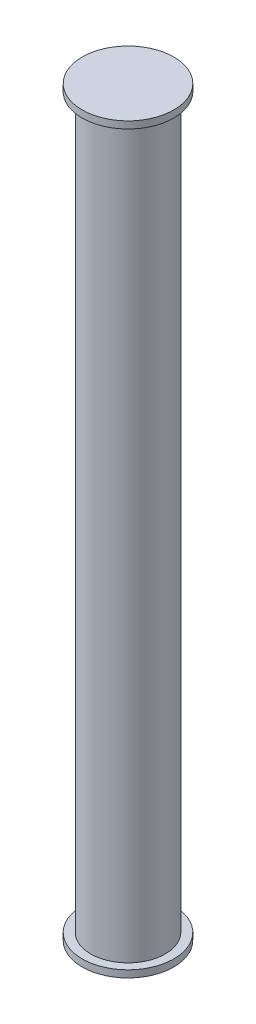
ISO-10303-21;
HEADER;
FILE_DESCRIPTION(('STEP AP214'),'2;1');
FILE_NAME('part.step','',(''),(''),'','','');
FILE_SCHEMA(('AUTOMOTIVE_DESIGN { 1 0 10303 214 1 1 1 1 }'));
ENDSEC;
DATA;
#1=APPLICATION_CONTEXT('core data for automotive mechanical design processes');
#2=APPLICATION_PROTOCOL_DEFINITION('international standard','automotive_design',2000,#1);
#3=PRODUCT_CONTEXT('',#1,'mechanical');
#4=PRODUCT('Part','Part','',(#3));
#5=PRODUCT_RELATED_PRODUCT_CATEGORY('part','',(#4));
#6=PRODUCT_DEFINITION_FORMATION('','',#4);
#7=PRODUCT_DEFINITION_CONTEXT('part definition',#1,'design');
#8=PRODUCT_DEFINITION('design','',#6,#7);
#9=PRODUCT_DEFINITION_SHAPE('','',#8);
#10=(LENGTH_UNIT() NAMED_UNIT(*) SI_UNIT(.MILLI.,.METRE.));
#11=(NAMED_UNIT(*) PLANE_ANGLE_UNIT() SI_UNIT($,.RADIAN.));
#12=(NAMED_UNIT(*) SI_UNIT($,.STERADIAN.) SOLID_ANGLE_UNIT());
#13=UNCERTAINTY_MEASURE_WITH_UNIT(LENGTH_MEASURE(1.E-05),#10,'distance_accuracy_value','');
#14=(GEOMETRIC_REPRESENTATION_CONTEXT(3) GLOBAL_UNCERTAINTY_ASSIGNED_CONTEXT((#13)) GLOBAL_UNIT_ASSIGNED_CONTEXT((#10,
#11,#12)) REPRESENTATION_CONTEXT('',''));
#15=CARTESIAN_POINT('',(0.,0.,0.));
#16=DIRECTION('',(0.,0.,1.));
#17=DIRECTION('',(1.,0.,0.));
#18=AXIS2_PLACEMENT_3D('',#15,#16,#17);
#19=CARTESIAN_POINT('',(0.,31.263,0.));
#20=DIRECTION('',(0.,1.,0.));
#21=DIRECTION('',(0.,0.,1.));
#22=AXIS2_PLACEMENT_3D('',#19,#20,#21);
#23=PLANE('',#22);
#24=CARTESIAN_POINT('',(0.,31.263,0.));
#25=DIRECTION('',(0.,1.,0.));
#26=DIRECTION('',(0.,0.,1.));
#27=AXIS2_PLACEMENT_3D('',#24,#25,#26);
#28=CIRCLE('',#27,1.95);
#29=CARTESIAN_POINT('',(0.,31.263,1.95));
#30=VERTEX_POINT('',#29);
#31=EDGE_CURVE('E18',#30,#30,#28,.F.);
#32=ORIENTED_EDGE('',*,*,#31,.F.);
#33=EDGE_LOOP('',(#32));
#34=FACE_BOUND('',#33,.T.);
#35=ADVANCED_FACE('F15',(#34),#23,.T.);
#36=CARTESIAN_POINT('',(0.,-0.3,0.));
#37=DIRECTION('',(0.,1.,0.));
#38=DIRECTION('',(0.,0.,1.));
#39=AXIS2_PLACEMENT_3D('',#36,#37,#38);
#40=PLANE('',#39);
#41=CARTESIAN_POINT('',(0.,-0.3,0.));
#42=DIRECTION('',(0.,-1.,0.));
#43=DIRECTION('',(0.,0.,-1.));
#44=AXIS2_PLACEMENT_3D('',#41,#42,#43);
#45=CIRCLE('',#44,1.95);
#46=CARTESIAN_POINT('',(0.,-0.3,-1.95));
#47=VERTEX_POINT('',#46);
#48=EDGE_CURVE('E34',#47,#47,#45,.F.);
#49=ORIENTED_EDGE('',*,*,#48,.F.);
#50=EDGE_LOOP('',(#49));
#51=FACE_BOUND('',#50,.T.);
#52=ADVANCED_FACE('F44',(#51),#40,.F.);
#53=CARTESIAN_POINT('',(0.,30.963,0.));
#54=DIRECTION('',(0.,1.,0.));
#55=DIRECTION('',(0.,0.,1.));
#56=AXIS2_PLACEMENT_3D('',#53,#54,#55);
#57=CYLINDRICAL_SURFACE('',#56,1.95);
#58=CARTESIAN_POINT('',(0.,30.963,0.));
#59=DIRECTION('',(0.,1.,0.));
#60=DIRECTION('',(0.,0.,1.));
#61=AXIS2_PLACEMENT_3D('',#58,#59,#60);
#62=CIRCLE('',#61,1.95);
#63=CARTESIAN_POINT('',(0.,30.963,1.95));
#64=VERTEX_POINT('',#63);
#65=EDGE_CURVE('E32',#64,#64,#62,.T.);
#66=ORIENTED_EDGE('',*,*,#65,.T.);
#67=EDGE_LOOP('',(#66));
#68=FACE_BOUND('',#67,.T.);
#69=ORIENTED_EDGE('',*,*,#31,.T.);
#70=EDGE_LOOP('',(#69));
#71=FACE_BOUND('',#70,.T.);
#72=ADVANCED_FACE('F41',(#68,#71),#57,.T.);
#73=CARTESIAN_POINT('',(0.,0.,0.));
#74=DIRECTION('',(0.,-1.,0.));
#75=DIRECTION('',(0.,0.,-1.));
#76=AXIS2_PLACEMENT_3D('',#73,#74,#75);
#77=CYLINDRICAL_SURFACE('',#76,1.95);
#78=CARTESIAN_POINT('',(0.,0.,0.));
#79=DIRECTION('',(0.,-1.,0.));
#80=DIRECTION('',(0.,0.,-1.));
#81=AXIS2_PLACEMENT_3D('',#78,#79,#80);
#82=CIRCLE('',#81,1.95);
#83=CARTESIAN_POINT('',(0.,0.,-1.95));
#84=VERTEX_POINT('',#83);
#85=EDGE_CURVE('E27',#84,#84,#82,.F.);
#86=ORIENTED_EDGE('',*,*,#85,.F.);
#87=EDGE_LOOP('',(#86));
#88=FACE_BOUND('',#87,.T.);
#89=ORIENTED_EDGE('',*,*,#48,.T.);
#90=EDGE_LOOP('',(#89));
#91=FACE_BOUND('',#90,.T.);
#92=ADVANCED_FACE('F64',(#88,#91),#77,.T.);
#93=CARTESIAN_POINT('',(0.,30.963,0.));
#94=DIRECTION('',(0.,1.,0.));
#95=DIRECTION('',(0.,0.,1.));
#96=AXIS2_PLACEMENT_3D('',#93,#94,#95);
#97=PLANE('',#96);
#98=CARTESIAN_POINT('',(0.,30.963,0.));
#99=DIRECTION('',(0.,1.,0.));
#100=DIRECTION('',(0.,0.,1.));
#101=AXIS2_PLACEMENT_3D('',#98,#99,#100);
#102=CIRCLE('',#101,1.5875);
#103=CARTESIAN_POINT('',(0.,30.963,1.5875));
#104=VERTEX_POINT('',#103);
#105=EDGE_CURVE('E22',#104,#104,#102,.F.);
#106=ORIENTED_EDGE('',*,*,#105,.F.);
#107=EDGE_LOOP('',(#106));
#108=FACE_BOUND('',#107,.T.);
#109=ORIENTED_EDGE('',*,*,#65,.F.);
#110=EDGE_LOOP('',(#109));
#111=FACE_BOUND('',#110,.T.);
#112=ADVANCED_FACE('F57',(#108,#111),#97,.F.);
#113=CARTESIAN_POINT('',(0.,0.,0.));
#114=DIRECTION('',(0.,1.,0.));
#115=DIRECTION('',(0.,0.,1.));
#116=AXIS2_PLACEMENT_3D('',#113,#114,#115);
#117=PLANE('',#116);
#118=CARTESIAN_POINT('',(0.,0.,0.));
#119=DIRECTION('',(0.,1.,0.));
#120=DIRECTION('',(0.,0.,1.));
#121=AXIS2_PLACEMENT_3D('',#118,#119,#120);
#122=CIRCLE('',#121,1.5875);
#123=CARTESIAN_POINT('',(0.,0.,1.5875));
#124=VERTEX_POINT('',#123);
#125=EDGE_CURVE('E10',#124,#124,#122,.T.);
#126=ORIENTED_EDGE('',*,*,#125,.F.);
#127=EDGE_LOOP('',(#126));
#128=FACE_BOUND('',#127,.T.);
#129=ORIENTED_EDGE('',*,*,#85,.T.);
#130=EDGE_LOOP('',(#129));
#131=FACE_BOUND('',#130,.T.);
#132=ADVANCED_FACE('F52',(#128,#131),#117,.T.);
#133=CARTESIAN_POINT('',(0.,0.,0.));
#134=DIRECTION('',(0.,1.,0.));
#135=DIRECTION('',(0.,0.,1.));
#136=AXIS2_PLACEMENT_3D('',#133,#134,#135);
#137=CYLINDRICAL_SURFACE('',#136,1.5875);
#138=ORIENTED_EDGE('',*,*,#125,.T.);
#139=EDGE_LOOP('',(#138));
#140=FACE_BOUND('',#139,.T.);
#141=ORIENTED_EDGE('',*,*,#105,.T.);
#142=EDGE_LOOP('',(#141));
#143=FACE_BOUND('',#142,.T.);
#144=ADVANCED_FACE('F50',(#140,#143),#137,.T.);
#145=CLOSED_SHELL('',(#35,#52,#72,#92,#112,#132,#144));
#146=MANIFOLD_SOLID_BREP('B1',#145);
#147=ADVANCED_BREP_SHAPE_REPRESENTATION('',(#18,#146),#14);
#148=SHAPE_DEFINITION_REPRESENTATION(#9,#147);
ENDSEC;
END-ISO-10303-21;
